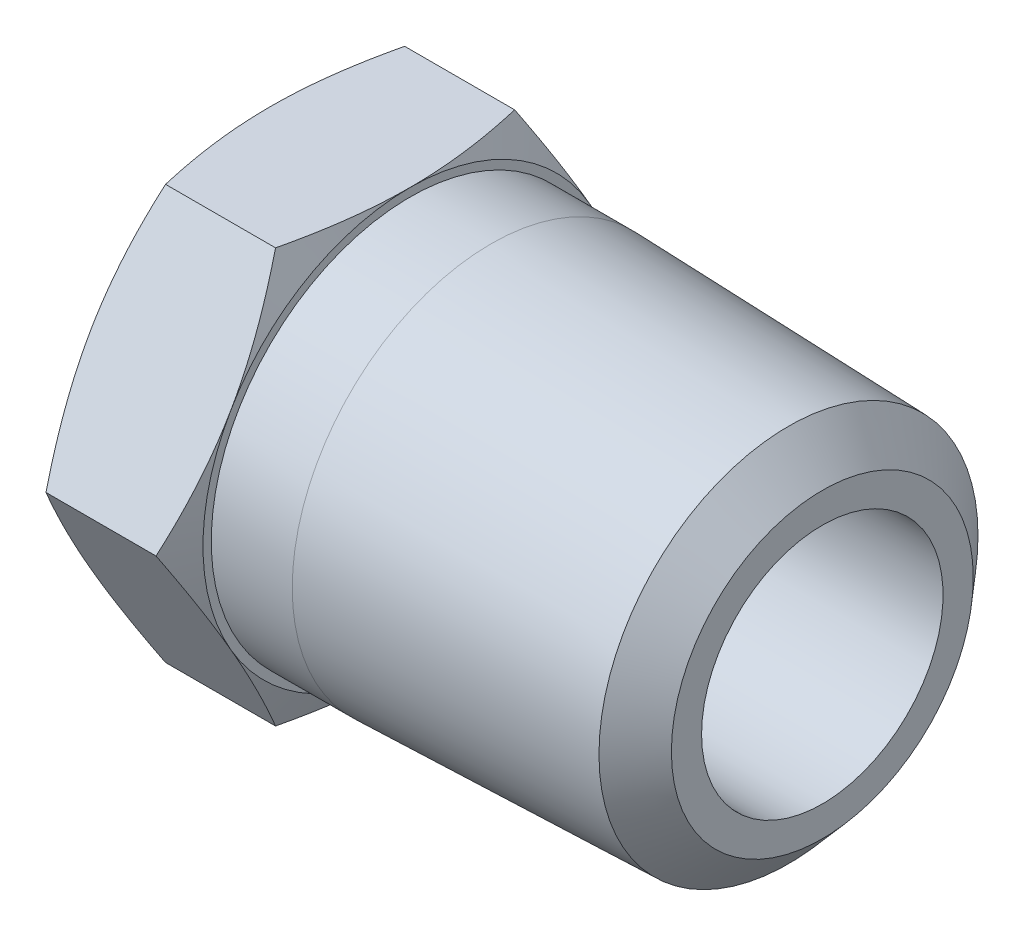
ISO-10303-21;
HEADER;
FILE_DESCRIPTION(('STEP AP214'),'2;1');
FILE_NAME('part.step','',(''),(''),'','','');
FILE_SCHEMA(('AUTOMOTIVE_DESIGN { 1 0 10303 214 1 1 1 1 }'));
ENDSEC;
DATA;
#1=APPLICATION_CONTEXT('core data for automotive mechanical design processes');
#2=APPLICATION_PROTOCOL_DEFINITION('international standard','automotive_design',2000,#1);
#3=PRODUCT_CONTEXT('',#1,'mechanical');
#4=PRODUCT('Part','Part','',(#3));
#5=PRODUCT_RELATED_PRODUCT_CATEGORY('part','',(#4));
#6=PRODUCT_DEFINITION_FORMATION('','',#4);
#7=PRODUCT_DEFINITION_CONTEXT('part definition',#1,'design');
#8=PRODUCT_DEFINITION('design','',#6,#7);
#9=PRODUCT_DEFINITION_SHAPE('','',#8);
#10=(LENGTH_UNIT() NAMED_UNIT(*) SI_UNIT(.MILLI.,.METRE.));
#11=(NAMED_UNIT(*) PLANE_ANGLE_UNIT() SI_UNIT($,.RADIAN.));
#12=(NAMED_UNIT(*) SI_UNIT($,.STERADIAN.) SOLID_ANGLE_UNIT());
#13=UNCERTAINTY_MEASURE_WITH_UNIT(LENGTH_MEASURE(1.E-05),#10,'distance_accuracy_value','');
#14=(GEOMETRIC_REPRESENTATION_CONTEXT(3) GLOBAL_UNCERTAINTY_ASSIGNED_CONTEXT((#13)) GLOBAL_UNIT_ASSIGNED_CONTEXT((#10,
#11,#12)) REPRESENTATION_CONTEXT('',''));
#15=CARTESIAN_POINT('',(0.,0.,0.));
#16=DIRECTION('',(0.,0.,1.));
#17=DIRECTION('',(1.,0.,0.));
#18=AXIS2_PLACEMENT_3D('',#15,#16,#17);
#19=CARTESIAN_POINT('',(-2.8421709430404E-10,0.,0.));
#20=DIRECTION('',(-1.,0.,0.));
#21=DIRECTION('',(0.,0.,1.));
#22=AXIS2_PLACEMENT_3D('',#19,#20,#21);
#23=CONICAL_SURFACE('',#22,5.46099999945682,0.816517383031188);
#24=CARTESIAN_POINT('',(0.912001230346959,0.,0.));
#25=DIRECTION('',(-1.,0.,0.));
#26=DIRECTION('',(0.,1.,0.));
#27=AXIS2_PLACEMENT_3D('',#24,#25,#26);
#28=CIRCLE('',#27,4.49039459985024);
#29=CARTESIAN_POINT('',(0.912001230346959,4.49039459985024,0.));
#30=VERTEX_POINT('',#29);
#31=EDGE_CURVE('E380',#30,#30,#28,.F.);
#32=ORIENTED_EDGE('',*,*,#31,.T.);
#33=EDGE_LOOP('',(#32));
#34=FACE_BOUND('',#33,.T.);
#35=CARTESIAN_POINT('',(-4.44450907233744E-10,0.,0.));
#36=DIRECTION('',(-1.,0.,0.));
#37=DIRECTION('',(0.,0.,1.));
#38=AXIS2_PLACEMENT_3D('',#35,#36,#37);
#39=CIRCLE('',#38,5.46099999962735);
#40=CARTESIAN_POINT('',(-4.44450907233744E-10,0.,5.46099999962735));
#41=VERTEX_POINT('',#40);
#42=EDGE_CURVE('E20',#41,#41,#39,.T.);
#43=ORIENTED_EDGE('',*,*,#42,.T.);
#44=EDGE_LOOP('',(#43));
#45=FACE_BOUND('',#44,.T.);
#46=ADVANCED_FACE('F16',(#34,#45),#23,.F.);
#47=CARTESIAN_POINT('',(0.91200123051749,0.,0.));
#48=DIRECTION('',(-1.,0.,0.));
#49=DIRECTION('',(0.,0.,1.));
#50=AXIS2_PLACEMENT_3D('',#47,#48,#49);
#51=CONICAL_SURFACE('',#50,4.49039459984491,0.0311192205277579);
#52=CARTESIAN_POINT('',(6.858,0.,0.));
#53=DIRECTION('',(1.,0.,0.));
#54=DIRECTION('',(0.,0.,-1.));
#55=AXIS2_PLACEMENT_3D('',#52,#53,#54);
#56=CIRCLE('',#55,4.3053);
#57=CARTESIAN_POINT('',(6.858,0.,-4.3053));
#58=VERTEX_POINT('',#57);
#59=EDGE_CURVE('E114',#58,#58,#56,.T.);
#60=ORIENTED_EDGE('',*,*,#59,.T.);
#61=EDGE_LOOP('',(#60));
#62=FACE_BOUND('',#61,.T.);
#63=ORIENTED_EDGE('',*,*,#31,.F.);
#64=EDGE_LOOP('',(#63));
#65=FACE_BOUND('',#64,.T.);
#66=ADVANCED_FACE('F616',(#62,#65),#51,.F.);
#67=CARTESIAN_POINT('',(0.,0.,0.));
#68=DIRECTION('',(1.,0.,0.));
#69=DIRECTION('',(0.,0.,-1.));
#70=AXIS2_PLACEMENT_3D('',#67,#68,#69);
#71=PLANE('',#70);
#72=ORIENTED_EDGE('',*,*,#42,.F.);
#73=EDGE_LOOP('',(#72));
#74=FACE_BOUND('',#73,.T.);
#75=CARTESIAN_POINT('',(-4.63025830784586E-09,0.,0.));
#76=DIRECTION('',(1.,0.,0.));
#77=DIRECTION('',(0.,0.,-1.));
#78=AXIS2_PLACEMENT_3D('',#75,#76,#77);
#79=CIRCLE('',#78,7.14375000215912);
#80=CARTESIAN_POINT('',(-5.13366725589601E-09,-3.57187500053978,-6.18666897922));
#81=VERTEX_POINT('',#80);
#82=CARTESIAN_POINT('',(-5.13366519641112E-09,3.57187500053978,-6.18666897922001));
#83=VERTEX_POINT('',#82);
#84=EDGE_CURVE('E106',#81,#83,#79,.T.);
#85=ORIENTED_EDGE('',*,*,#84,.F.);
#86=CARTESIAN_POINT('',(-4.63025581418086E-09,0.,0.));
#87=DIRECTION('',(1.,0.,0.));
#88=DIRECTION('',(0.,0.,-1.));
#89=AXIS2_PLACEMENT_3D('',#86,#87,#88);
#90=CIRCLE('',#89,7.14375000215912);
#91=CARTESIAN_POINT('',(-5.13366379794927E-09,-7.14375000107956,0.));
#92=VERTEX_POINT('',#91);
#93=EDGE_CURVE('E125',#92,#81,#90,.T.);
#94=ORIENTED_EDGE('',*,*,#93,.F.);
#95=CARTESIAN_POINT('',(-4.63025874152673E-09,0.,0.));
#96=DIRECTION('',(1.,0.,0.));
#97=DIRECTION('',(0.,0.,-1.));
#98=AXIS2_PLACEMENT_3D('',#95,#96,#97);
#99=CIRCLE('',#98,7.14375000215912);
#100=CARTESIAN_POINT('',(-5.13366665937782E-09,-3.57187500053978,6.18666897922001));
#101=VERTEX_POINT('',#100);
#102=EDGE_CURVE('E445',#101,#92,#99,.T.);
#103=ORIENTED_EDGE('',*,*,#102,.F.);
#104=CARTESIAN_POINT('',(-4.63025874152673E-09,0.,0.));
#105=DIRECTION('',(1.,0.,0.));
#106=DIRECTION('',(0.,0.,-1.));
#107=AXIS2_PLACEMENT_3D('',#104,#105,#106);
#108=CIRCLE('',#107,7.14375000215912);
#109=CARTESIAN_POINT('',(-5.13366760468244E-09,3.57187500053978,6.18666897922));
#110=VERTEX_POINT('',#109);
#111=EDGE_CURVE('E447',#110,#101,#108,.T.);
#112=ORIENTED_EDGE('',*,*,#111,.F.);
#113=CARTESIAN_POINT('',(-4.63026524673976E-09,0.,0.));
#114=DIRECTION('',(1.,0.,0.));
#115=DIRECTION('',(0.,0.,-1.));
#116=AXIS2_PLACEMENT_3D('',#113,#114,#115);
#117=CIRCLE('',#116,7.1437500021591);
#118=CARTESIAN_POINT('',(-5.13367419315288E-09,7.14375000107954,0.));
#119=VERTEX_POINT('',#118);
#120=EDGE_CURVE('E109',#119,#110,#117,.T.);
#121=ORIENTED_EDGE('',*,*,#120,.F.);
#122=CARTESIAN_POINT('',(-4.63025841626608E-09,0.,0.));
#123=DIRECTION('',(1.,0.,0.));
#124=DIRECTION('',(0.,0.,-1.));
#125=AXIS2_PLACEMENT_3D('',#122,#123,#124);
#126=CIRCLE('',#125,7.14375000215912);
#127=EDGE_CURVE('E103',#83,#119,#126,.T.);
#128=ORIENTED_EDGE('',*,*,#127,.F.);
#129=EDGE_LOOP('',(#85,#94,#103,#112,#121,#128));
#130=FACE_BOUND('',#129,.T.);
#131=ADVANCED_FACE('F105',(#74,#130),#71,.F.);
#132=CARTESIAN_POINT('',(6.858,0.,0.));
#133=DIRECTION('',(1.,0.,0.));
#134=DIRECTION('',(0.,0.,-1.));
#135=AXIS2_PLACEMENT_3D('',#132,#133,#134);
#136=CYLINDRICAL_SURFACE('',#135,4.3053);
#137=ORIENTED_EDGE('',*,*,#59,.F.);
#138=EDGE_LOOP('',(#137));
#139=FACE_BOUND('',#138,.T.);
#140=CARTESIAN_POINT('',(9.652,0.,0.));
#141=DIRECTION('',(1.,0.,0.));
#142=DIRECTION('',(0.,0.,-1.));
#143=AXIS2_PLACEMENT_3D('',#140,#141,#142);
#144=CIRCLE('',#143,4.3053);
#145=CARTESIAN_POINT('',(9.652,0.,-4.3053));
#146=VERTEX_POINT('',#145);
#147=EDGE_CURVE('E124',#146,#146,#144,.T.);
#148=ORIENTED_EDGE('',*,*,#147,.T.);
#149=EDGE_LOOP('',(#148));
#150=FACE_BOUND('',#149,.T.);
#151=ADVANCED_FACE('F604',(#139,#150),#136,.F.);
#152=CARTESIAN_POINT('',(0.518428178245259,0.,0.));
#153=DIRECTION('',(1.,0.,0.));
#154=DIRECTION('',(0.,0.,-1.));
#155=AXIS2_PLACEMENT_3D('',#152,#153,#154);
#156=CONICAL_SURFACE('',#155,8.25552282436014,1.1344640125);
#157=ORIENTED_EDGE('',*,*,#127,.T.);
#158=CARTESIAN_POINT('',(0.515336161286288,7.14374999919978,-4.12444598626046));
#159=CARTESIAN_POINT('',(0.436409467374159,7.14374999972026,-3.7860516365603));
#160=CARTESIAN_POINT('',(0.364380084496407,7.14374999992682,-3.44583405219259));
#161=CARTESIAN_POINT('',(0.237587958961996,7.14375000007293,-2.76340602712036));
#162=CARTESIAN_POINT('',(0.182767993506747,7.14375000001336,-2.42120612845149));
#163=CARTESIAN_POINT('',(0.115642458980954,7.14374999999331,-1.90579460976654));
#164=CARTESIAN_POINT('',(0.0957794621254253,7.1437499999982,-1.73356525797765));
#165=CARTESIAN_POINT('',(0.0614360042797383,7.1437500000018,-1.38856894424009));
#166=CARTESIAN_POINT('',(0.046955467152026,7.14375000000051,-1.21580198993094));
#167=CARTESIAN_POINT('',(0.0236193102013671,7.14374999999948,-0.869306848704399));
#168=CARTESIAN_POINT('',(0.0147826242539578,7.14374999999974,-0.695577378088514));
#169=CARTESIAN_POINT('',(0.00296230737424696,7.14375000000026,-0.347900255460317));
#170=CARTESIAN_POINT('',(-2.06506062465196E-05,7.14375000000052,-0.173952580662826));
#171=CARTESIAN_POINT('',(-5.63708322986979E-09,7.14375,-1.09536908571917E-10));
#172=B_SPLINE_CURVE_WITH_KNOTS('',3,(#158,#159,#160,#161,#162,#163,#164,#165,#166,#167,#168,
#169,#170,#171),.UNSPECIFIED.,.F.,.F.,(4,2,2,2,2,2,4),(0.,1.04269338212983,2.08188206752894,
2.60191814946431,3.12194687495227,3.64371114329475,4.16553539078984),.UNSPECIFIED.);
#173=CARTESIAN_POINT('',(0.515336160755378,7.14375000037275,-4.1244459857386));
#174=VERTEX_POINT('',#173);
#175=EDGE_CURVE('E130',#174,#119,#172,.T.);
#176=ORIENTED_EDGE('',*,*,#175,.F.);
#177=CARTESIAN_POINT('',(-5.16726322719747E-09,3.57187499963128,-6.18666897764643));
#178=CARTESIAN_POINT('',(-2.06504383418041E-05,3.72252235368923,-6.09969268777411));
#179=CARTESIAN_POINT('',(0.00296230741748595,3.87316545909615,-6.01271885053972));
#180=CARTESIAN_POINT('',(0.0147826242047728,4.17426267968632,-5.83888028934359));
#181=CARTESIAN_POINT('',(0.0236193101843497,4.32471681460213,-5.75201555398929));
#182=CARTESIAN_POINT('',(0.0469554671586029,4.62479040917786,-5.57876798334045));
#183=CARTESIAN_POINT('',(0.0614360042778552,4.77441098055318,-5.49238450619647));
#184=CARTESIAN_POINT('',(0.0957794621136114,5.07318655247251,-5.3198863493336));
#185=CARTESIAN_POINT('',(0.115642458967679,5.2223415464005,-5.23377167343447));
#186=CARTESIAN_POINT('',(0.18276799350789,5.66870101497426,-4.97606591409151));
#187=CARTESIAN_POINT('',(0.237587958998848,5.96505482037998,-4.80496596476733));
#188=CARTESIAN_POINT('',(0.364380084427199,6.55605482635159,-4.46375195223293));
#189=CARTESIAN_POINT('',(0.436409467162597,6.8506918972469,-4.29364316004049));
#190=CARTESIAN_POINT('',(0.515336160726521,7.14375000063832,-4.12444598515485));
#191=B_SPLINE_CURVE_WITH_KNOTS('',3,(#177,#178,#179,#180,#181,#182,#183,#184,#185,#186,#187,
#188,#189,#190),.UNSPECIFIED.,.F.,.F.,(4,2,2,2,2,2,4),(0.,0.521824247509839,1.04358851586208,
1.56361724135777,2.08365332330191,3.12284200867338,4.16553539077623),.UNSPECIFIED.);
#192=EDGE_CURVE('E127',#83,#174,#191,.T.);
#193=ORIENTED_EDGE('',*,*,#192,.F.);
#194=EDGE_LOOP('',(#157,#176,#193));
#195=FACE_BOUND('',#194,.T.);
#196=ADVANCED_FACE('F128',(#195),#156,.T.);
#197=CARTESIAN_POINT('',(0.518428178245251,0.,0.));
#198=DIRECTION('',(1.,0.,0.));
#199=DIRECTION('',(0.,0.,-1.));
#200=AXIS2_PLACEMENT_3D('',#197,#198,#199);
#201=CONICAL_SURFACE('',#200,8.25552282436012,1.1344640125);
#202=CARTESIAN_POINT('',(-5.16727565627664E-09,7.14374999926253,0.));
#203=CARTESIAN_POINT('',(-2.06504383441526E-05,7.14374999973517,0.173952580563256));
#204=CARTESIAN_POINT('',(0.00296230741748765,7.14374999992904,0.347900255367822));
#205=CARTESIAN_POINT('',(0.0147826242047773,7.14375000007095,0.695577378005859));
#206=CARTESIAN_POINT('',(0.0236193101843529,7.14375000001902,0.869306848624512));
#207=CARTESIAN_POINT('',(0.046955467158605,7.14374999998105,1.21580198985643));
#208=CARTESIAN_POINT('',(0.0614360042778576,7.14374999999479,1.38856894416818));
#209=CARTESIAN_POINT('',(0.095779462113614,7.14375000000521,1.73356525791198));
#210=CARTESIAN_POINT('',(0.115642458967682,7.1437500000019,1.90579460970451));
#211=CARTESIAN_POINT('',(0.182767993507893,7.14374999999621,2.42120612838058));
#212=CARTESIAN_POINT('',(0.237587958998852,7.1437499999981,2.76340602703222));
#213=CARTESIAN_POINT('',(0.364380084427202,7.1437500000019,3.44583405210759));
#214=CARTESIAN_POINT('',(0.436409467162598,7.14375000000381,3.78605163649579));
#215=CARTESIAN_POINT('',(0.515336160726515,7.14375,4.12444598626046));
#216=B_SPLINE_CURVE_WITH_KNOTS('',3,(#202,#203,#204,#205,#206,#207,#208,#209,#210,#211,#212,
#213,#214,#215),.UNSPECIFIED.,.F.,.F.,(4,2,2,2,2,2,4),(0.,0.52182424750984,1.04358851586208,
1.56361724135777,2.08365332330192,3.12284200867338,4.16553539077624),.UNSPECIFIED.);
#217=CARTESIAN_POINT('',(0.515336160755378,7.14375000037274,4.1244459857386));
#218=VERTEX_POINT('',#217);
#219=EDGE_CURVE('E299',#119,#218,#216,.T.);
#220=ORIENTED_EDGE('',*,*,#219,.F.);
#221=ORIENTED_EDGE('',*,*,#120,.T.);
#222=CARTESIAN_POINT('',(0.515336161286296,7.14375000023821,4.12444598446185));
#223=CARTESIAN_POINT('',(0.436409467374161,6.85069189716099,4.29364315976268));
#224=CARTESIAN_POINT('',(0.364380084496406,6.55605482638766,4.46375195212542));
#225=CARTESIAN_POINT('',(0.237587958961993,5.96505482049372,4.80496596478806));
#226=CARTESIAN_POINT('',(0.182767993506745,5.66870101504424,4.9760659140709));
#227=CARTESIAN_POINT('',(0.115642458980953,5.22234154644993,5.23377167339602));
#228=CARTESIAN_POINT('',(0.0957794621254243,5.07318655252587,5.31988634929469));
#229=CARTESIAN_POINT('',(0.0614360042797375,4.77441098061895,5.49238450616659));
#230=CARTESIAN_POINT('',(0.0469554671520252,4.62479040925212,5.57876798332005));
#231=CARTESIAN_POINT('',(0.0236193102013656,4.32471681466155,5.75201555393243));
#232=CARTESIAN_POINT('',(0.0147826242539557,4.1742626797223,5.8388802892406));
#233=CARTESIAN_POINT('',(0.00296230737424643,3.87316545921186,6.01271885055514));
#234=CARTESIAN_POINT('',(-2.06506062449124E-05,3.72252235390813,6.09969268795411));
#235=CARTESIAN_POINT('',(-5.63707645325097E-09,3.57187500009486,6.1866689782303));
#236=B_SPLINE_CURVE_WITH_KNOTS('',3,(#222,#223,#224,#225,#226,#227,#228,#229,#230,#231,#232,
#233,#234,#235),.UNSPECIFIED.,.F.,.F.,(4,2,2,2,2,2,4),(0.,1.04269338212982,2.08188206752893,
2.6019181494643,3.12194687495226,3.64371114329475,4.16553539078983),.UNSPECIFIED.);
#237=EDGE_CURVE('E292',#218,#110,#236,.T.);
#238=ORIENTED_EDGE('',*,*,#237,.F.);
#239=EDGE_LOOP('',(#220,#221,#238));
#240=FACE_BOUND('',#239,.T.);
#241=ADVANCED_FACE('F282',(#240),#201,.T.);
#242=CARTESIAN_POINT('',(0.518428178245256,0.,0.));
#243=DIRECTION('',(1.,0.,0.));
#244=DIRECTION('',(0.,0.,-1.));
#245=AXIS2_PLACEMENT_3D('',#242,#243,#244);
#246=CONICAL_SURFACE('',#245,8.25552282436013,1.1344640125);
#247=CARTESIAN_POINT('',(-5.16726926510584E-09,3.57187499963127,6.18666897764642));
#248=CARTESIAN_POINT('',(-2.06504383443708E-05,3.42122764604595,6.27364526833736));
#249=CARTESIAN_POINT('',(0.00296230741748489,3.27058454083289,6.36061910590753));
#250=CARTESIAN_POINT('',(0.0147826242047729,2.96948732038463,6.53445766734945));
#251=CARTESIAN_POINT('',(0.0236193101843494,2.81903318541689,6.6213224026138));
#252=CARTESIAN_POINT('',(0.046955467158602,2.51895959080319,6.79456997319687));
#253=CARTESIAN_POINT('',(0.0614360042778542,2.36933901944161,6.88095345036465));
#254=CARTESIAN_POINT('',(0.0957794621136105,2.07056344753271,7.05345160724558));
#255=CARTESIAN_POINT('',(0.115642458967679,1.92140845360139,7.13956628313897));
#256=CARTESIAN_POINT('',(0.18276799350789,1.47504898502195,7.39727204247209));
#257=CARTESIAN_POINT('',(0.237587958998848,1.17869517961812,7.56837199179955));
#258=CARTESIAN_POINT('',(0.364380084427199,0.587695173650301,7.90958600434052));
#259=CARTESIAN_POINT('',(0.436409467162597,0.293058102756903,8.07969479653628));
#260=CARTESIAN_POINT('',(0.51533616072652,-6.3832992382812E-10,8.24889197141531));
#261=B_SPLINE_CURVE_WITH_KNOTS('',3,(#247,#248,#249,#250,#251,#252,#253,#254,#255,#256,#257,
#258,#259,#260),.UNSPECIFIED.,.F.,.F.,(4,2,2,2,2,2,4),(0.,0.521824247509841,1.04358851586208,
1.56361724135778,2.08365332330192,3.12284200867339,4.16553539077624),.UNSPECIFIED.);
#262=CARTESIAN_POINT('',(0.515336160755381,0.,8.2488919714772));
#263=VERTEX_POINT('',#262);
#264=EDGE_CURVE('E286',#110,#263,#261,.T.);
#265=ORIENTED_EDGE('',*,*,#264,.F.);
#266=ORIENTED_EDGE('',*,*,#111,.T.);
#267=CARTESIAN_POINT('',(0.515336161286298,1.03842624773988E-09,8.24889197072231));
#268=CARTESIAN_POINT('',(0.436409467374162,-0.293058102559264,8.07969479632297));
#269=CARTESIAN_POINT('',(0.364380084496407,-0.587695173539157,7.909586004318));
#270=CARTESIAN_POINT('',(0.237587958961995,-1.1786951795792,7.56837199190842));
#271=CARTESIAN_POINT('',(0.182767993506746,-1.47504898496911,7.3972720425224));
#272=CARTESIAN_POINT('',(0.115642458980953,-1.92140845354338,7.13956628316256));
#273=CARTESIAN_POINT('',(0.0957794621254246,-2.07056344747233,7.05345160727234));
#274=CARTESIAN_POINT('',(0.0614360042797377,-2.36933901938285,6.88095345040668));
#275=CARTESIAN_POINT('',(0.0469554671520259,-2.51895959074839,6.79456997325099));
#276=CARTESIAN_POINT('',(0.0236193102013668,-2.81903318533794,6.62132240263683));
#277=CARTESIAN_POINT('',(0.0147826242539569,-2.96948732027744,6.53445766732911));
#278=CARTESIAN_POINT('',(0.00296230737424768,-3.2705845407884,6.36061910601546));
#279=CARTESIAN_POINT('',(-2.06506062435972E-05,-3.42122764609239,6.27364526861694));
#280=CARTESIAN_POINT('',(-5.63707475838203E-09,-3.57187499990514,6.18666897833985));
#281=B_SPLINE_CURVE_WITH_KNOTS('',3,(#267,#268,#269,#270,#271,#272,#273,#274,#275,#276,#277,
#278,#279,#280),.UNSPECIFIED.,.F.,.F.,(4,2,2,2,2,2,4),(0.,1.04269338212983,2.08188206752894,
2.60191814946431,3.12194687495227,3.64371114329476,4.16553539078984),.UNSPECIFIED.);
#282=EDGE_CURVE('E263',#263,#101,#281,.T.);
#283=ORIENTED_EDGE('',*,*,#282,.F.);
#284=EDGE_LOOP('',(#265,#266,#283));
#285=FACE_BOUND('',#284,.T.);
#286=ADVANCED_FACE('F276',(#285),#246,.T.);
#287=CARTESIAN_POINT('',(0.518428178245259,0.,0.));
#288=DIRECTION('',(1.,0.,0.));
#289=DIRECTION('',(0.,0.,-1.));
#290=AXIS2_PLACEMENT_3D('',#287,#288,#289);
#291=CONICAL_SURFACE('',#290,8.25552282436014,1.1344640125);
#292=CARTESIAN_POINT('',(-5.16726727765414E-09,-3.57187499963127,6.18666897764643));
#293=CARTESIAN_POINT('',(-2.06504383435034E-05,-3.72252235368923,6.09969268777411));
#294=CARTESIAN_POINT('',(0.00296230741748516,-3.87316545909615,6.01271885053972));
#295=CARTESIAN_POINT('',(0.0147826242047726,-4.17426267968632,5.83888028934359));
#296=CARTESIAN_POINT('',(0.0236193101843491,-4.32471681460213,5.75201555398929));
#297=CARTESIAN_POINT('',(0.0469554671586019,-4.62479040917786,5.57876798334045));
#298=CARTESIAN_POINT('',(0.0614360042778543,-4.77441098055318,5.49238450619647));
#299=CARTESIAN_POINT('',(0.0957794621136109,-5.07318655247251,5.3198863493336));
#300=CARTESIAN_POINT('',(0.115642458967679,-5.2223415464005,5.23377167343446));
#301=CARTESIAN_POINT('',(0.182767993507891,-5.66870101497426,4.97606591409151));
#302=CARTESIAN_POINT('',(0.237587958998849,-5.96505482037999,4.80496596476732));
#303=CARTESIAN_POINT('',(0.364380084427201,-6.5560548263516,4.46375195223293));
#304=CARTESIAN_POINT('',(0.436409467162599,-6.85069189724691,4.29364316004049));
#305=CARTESIAN_POINT('',(0.515336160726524,-7.14375000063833,4.12444598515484));
#306=B_SPLINE_CURVE_WITH_KNOTS('',3,(#292,#293,#294,#295,#296,#297,#298,#299,#300,#301,#302,
#303,#304,#305),.UNSPECIFIED.,.F.,.F.,(4,2,2,2,2,2,4),(0.,0.521824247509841,1.04358851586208,
1.56361724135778,2.08365332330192,3.12284200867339,4.16553539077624),.UNSPECIFIED.);
#307=CARTESIAN_POINT('',(0.515336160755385,-7.14375000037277,4.1244459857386));
#308=VERTEX_POINT('',#307);
#309=EDGE_CURVE('E257',#101,#308,#306,.T.);
#310=ORIENTED_EDGE('',*,*,#309,.F.);
#311=ORIENTED_EDGE('',*,*,#102,.T.);
#312=CARTESIAN_POINT('',(0.5153361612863,-7.1437499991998,4.12444598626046));
#313=CARTESIAN_POINT('',(0.436409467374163,-7.14374999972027,3.7860516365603));
#314=CARTESIAN_POINT('',(0.364380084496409,-7.14374999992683,3.44583405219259));
#315=CARTESIAN_POINT('',(0.237587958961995,-7.14375000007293,2.76340602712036));
#316=CARTESIAN_POINT('',(0.182767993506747,-7.14375000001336,2.4212061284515));
#317=CARTESIAN_POINT('',(0.115642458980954,-7.14374999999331,1.90579460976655));
#318=CARTESIAN_POINT('',(0.0957794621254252,-7.1437499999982,1.73356525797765));
#319=CARTESIAN_POINT('',(0.0614360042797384,-7.1437500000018,1.38856894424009));
#320=CARTESIAN_POINT('',(0.0469554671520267,-7.14375000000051,1.21580198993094));
#321=CARTESIAN_POINT('',(0.0236193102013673,-7.14374999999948,0.8693068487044));
#322=CARTESIAN_POINT('',(0.0147826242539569,-7.14374999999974,0.695577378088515));
#323=CARTESIAN_POINT('',(0.00296230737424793,-7.14375000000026,0.347900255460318));
#324=CARTESIAN_POINT('',(-2.06506062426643E-05,-7.14375000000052,0.173952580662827));
#325=CARTESIAN_POINT('',(-5.63707173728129E-09,-7.14375,1.0953768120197E-10));
#326=B_SPLINE_CURVE_WITH_KNOTS('',3,(#312,#313,#314,#315,#316,#317,#318,#319,#320,#321,#322,
#323,#324,#325),.UNSPECIFIED.,.F.,.F.,(4,2,2,2,2,2,4),(0.,1.04269338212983,2.08188206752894,
2.60191814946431,3.12194687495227,3.64371114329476,4.16553539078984),.UNSPECIFIED.);
#327=EDGE_CURVE('E264',#308,#92,#326,.T.);
#328=ORIENTED_EDGE('',*,*,#327,.F.);
#329=EDGE_LOOP('',(#310,#311,#328));
#330=FACE_BOUND('',#329,.T.);
#331=ADVANCED_FACE('F273',(#330),#291,.T.);
#332=CARTESIAN_POINT('',(0.518428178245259,0.,0.));
#333=DIRECTION('',(1.,0.,0.));
#334=DIRECTION('',(0.,0.,-1.));
#335=AXIS2_PLACEMENT_3D('',#332,#333,#334);
#336=CONICAL_SURFACE('',#335,8.25552282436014,1.1344640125);
#337=ORIENTED_EDGE('',*,*,#93,.T.);
#338=CARTESIAN_POINT('',(0.515336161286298,-7.14375000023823,-4.12444598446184));
#339=CARTESIAN_POINT('',(0.436409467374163,-6.85069189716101,-4.29364315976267));
#340=CARTESIAN_POINT('',(0.364380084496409,-6.55605482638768,-4.46375195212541));
#341=CARTESIAN_POINT('',(0.237587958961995,-5.96505482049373,-4.80496596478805));
#342=CARTESIAN_POINT('',(0.182767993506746,-5.66870101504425,-4.97606591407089));
#343=CARTESIAN_POINT('',(0.115642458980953,-5.22234154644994,-5.23377167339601));
#344=CARTESIAN_POINT('',(0.095779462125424,-5.07318655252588,-5.31988634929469));
#345=CARTESIAN_POINT('',(0.0614360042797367,-4.77441098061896,-5.49238450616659));
#346=CARTESIAN_POINT('',(0.0469554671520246,-4.62479040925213,-5.57876798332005));
#347=CARTESIAN_POINT('',(0.023619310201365,-4.32471681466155,-5.75201555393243));
#348=CARTESIAN_POINT('',(0.0147826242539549,-4.1742626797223,-5.83888028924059));
#349=CARTESIAN_POINT('',(0.00296230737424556,-3.87316545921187,-6.01271885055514));
#350=CARTESIAN_POINT('',(-2.06506062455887E-05,-3.72252235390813,-6.09969268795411));
#351=CARTESIAN_POINT('',(-5.63707632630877E-09,-3.57187500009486,-6.1866689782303));
#352=B_SPLINE_CURVE_WITH_KNOTS('',3,(#338,#339,#340,#341,#342,#343,#344,#345,#346,#347,#348,
#349,#350,#351),.UNSPECIFIED.,.F.,.F.,(4,2,2,2,2,2,4),(0.,1.04269338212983,2.08188206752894,
2.60191814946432,3.12194687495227,3.64371114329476,4.16553539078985),.UNSPECIFIED.);
#353=CARTESIAN_POINT('',(0.515336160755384,-7.14375000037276,-4.1244459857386));
#354=VERTEX_POINT('',#353);
#355=EDGE_CURVE('E168',#354,#81,#352,.T.);
#356=ORIENTED_EDGE('',*,*,#355,.F.);
#357=CARTESIAN_POINT('',(-5.16726467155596E-09,-7.14374999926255,0.));
#358=CARTESIAN_POINT('',(-2.06504383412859E-05,-7.14374999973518,-0.173952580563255));
#359=CARTESIAN_POINT('',(0.00296230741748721,-7.14374999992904,-0.347900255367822));
#360=CARTESIAN_POINT('',(0.0147826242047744,-7.14375000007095,-0.695577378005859));
#361=CARTESIAN_POINT('',(0.023619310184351,-7.14375000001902,-0.869306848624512));
#362=CARTESIAN_POINT('',(0.0469554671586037,-7.14374999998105,-1.21580198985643));
#363=CARTESIAN_POINT('',(0.061436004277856,-7.14374999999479,-1.38856894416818));
#364=CARTESIAN_POINT('',(0.0957794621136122,-7.14375000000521,-1.73356525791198));
#365=CARTESIAN_POINT('',(0.11564245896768,-7.1437500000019,-1.90579460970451));
#366=CARTESIAN_POINT('',(0.182767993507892,-7.14374999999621,-2.42120612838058));
#367=CARTESIAN_POINT('',(0.237587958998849,-7.1437499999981,-2.76340602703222));
#368=CARTESIAN_POINT('',(0.3643800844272,-7.1437500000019,-3.44583405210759));
#369=CARTESIAN_POINT('',(0.436409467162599,-7.14375000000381,-3.78605163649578));
#370=CARTESIAN_POINT('',(0.515336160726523,-7.14375,-4.12444598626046));
#371=B_SPLINE_CURVE_WITH_KNOTS('',3,(#357,#358,#359,#360,#361,#362,#363,#364,#365,#366,#367,
#368,#369,#370),.UNSPECIFIED.,.F.,.F.,(4,2,2,2,2,2,4),(0.,0.52182424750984,1.04358851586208,
1.56361724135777,2.08365332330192,3.12284200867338,4.16553539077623),.UNSPECIFIED.);
#372=EDGE_CURVE('E370',#92,#354,#371,.T.);
#373=ORIENTED_EDGE('',*,*,#372,.F.);
#374=EDGE_LOOP('',(#337,#356,#373));
#375=FACE_BOUND('',#374,.T.);
#376=ADVANCED_FACE('F157',(#375),#336,.T.);
#377=CARTESIAN_POINT('',(0.518428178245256,0.,0.));
#378=DIRECTION('',(1.,0.,0.));
#379=DIRECTION('',(0.,0.,-1.));
#380=AXIS2_PLACEMENT_3D('',#377,#378,#379);
#381=CONICAL_SURFACE('',#380,8.25552282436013,1.1344640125);
#382=ORIENTED_EDGE('',*,*,#84,.T.);
#383=CARTESIAN_POINT('',(0.515336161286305,-1.03842348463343E-09,-8.24889197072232));
#384=CARTESIAN_POINT('',(0.436409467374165,0.293058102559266,-8.07969479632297));
#385=CARTESIAN_POINT('',(0.36438008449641,0.587695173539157,-7.90958600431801));
#386=CARTESIAN_POINT('',(0.237587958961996,1.1786951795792,-7.56837199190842));
#387=CARTESIAN_POINT('',(0.182767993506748,1.47504898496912,-7.3972720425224));
#388=CARTESIAN_POINT('',(0.115642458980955,1.92140845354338,-7.13956628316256));
#389=CARTESIAN_POINT('',(0.0957794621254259,2.07056344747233,-7.05345160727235));
#390=CARTESIAN_POINT('',(0.0614360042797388,2.36933901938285,-6.88095345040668));
#391=CARTESIAN_POINT('',(0.0469554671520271,2.51895959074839,-6.794569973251));
#392=CARTESIAN_POINT('',(0.023619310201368,2.81903318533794,-6.62132240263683));
#393=CARTESIAN_POINT('',(0.0147826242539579,2.96948732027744,-6.53445766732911));
#394=CARTESIAN_POINT('',(0.00296230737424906,3.2705845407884,-6.36061910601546));
#395=CARTESIAN_POINT('',(-2.06506062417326E-05,3.42122764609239,-6.27364526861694));
#396=CARTESIAN_POINT('',(-5.63707169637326E-09,3.57187499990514,-6.18666897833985));
#397=B_SPLINE_CURVE_WITH_KNOTS('',3,(#383,#384,#385,#386,#387,#388,#389,#390,#391,#392,#393,
#394,#395,#396),.UNSPECIFIED.,.F.,.F.,(4,2,2,2,2,2,4),(0.,1.04269338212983,2.08188206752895,
2.60191814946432,3.12194687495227,3.64371114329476,4.16553539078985),.UNSPECIFIED.);
#398=CARTESIAN_POINT('',(0.515336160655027,-3.72760723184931E-10,-8.24889197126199));
#399=VERTEX_POINT('',#398);
#400=EDGE_CURVE('E119',#399,#83,#397,.T.);
#401=ORIENTED_EDGE('',*,*,#400,.F.);
#402=CARTESIAN_POINT('',(-5.16726927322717E-09,-3.57187499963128,-6.18666897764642));
#403=CARTESIAN_POINT('',(-2.06504383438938E-05,-3.42122764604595,-6.27364526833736));
#404=CARTESIAN_POINT('',(0.00296230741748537,-3.2705845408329,-6.36061910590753));
#405=CARTESIAN_POINT('',(0.0147826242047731,-2.96948732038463,-6.53445766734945));
#406=CARTESIAN_POINT('',(0.0236193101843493,-2.81903318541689,-6.6213224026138));
#407=CARTESIAN_POINT('',(0.0469554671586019,-2.51895959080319,-6.79456997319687));
#408=CARTESIAN_POINT('',(0.0614360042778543,-2.36933901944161,-6.88095345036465));
#409=CARTESIAN_POINT('',(0.0957794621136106,-2.07056344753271,-7.05345160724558));
#410=CARTESIAN_POINT('',(0.115642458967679,-1.92140845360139,-7.13956628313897));
#411=CARTESIAN_POINT('',(0.18276799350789,-1.47504898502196,-7.39727204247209));
#412=CARTESIAN_POINT('',(0.237587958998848,-1.17869517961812,-7.56837199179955));
#413=CARTESIAN_POINT('',(0.3643800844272,-0.587695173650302,-7.90958600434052));
#414=CARTESIAN_POINT('',(0.436409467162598,-0.293058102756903,-8.07969479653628));
#415=CARTESIAN_POINT('',(0.51533616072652,6.38330998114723E-10,-8.24889197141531));
#416=B_SPLINE_CURVE_WITH_KNOTS('',3,(#402,#403,#404,#405,#406,#407,#408,#409,#410,#411,#412,
#413,#414,#415),.UNSPECIFIED.,.F.,.F.,(4,2,2,2,2,2,4),(0.,0.521824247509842,1.04358851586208,
1.56361724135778,2.08365332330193,3.12284200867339,4.16553539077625),.UNSPECIFIED.);
#417=EDGE_CURVE('E122',#81,#399,#416,.T.);
#418=ORIENTED_EDGE('',*,*,#417,.F.);
#419=EDGE_LOOP('',(#382,#401,#418));
#420=FACE_BOUND('',#419,.T.);
#421=ADVANCED_FACE('F117',(#420),#381,.T.);
#422=CARTESIAN_POINT('',(9.652,4.3053,4.391406));
#423=DIRECTION('',(1.,0.,0.));
#424=DIRECTION('',(0.,-1.,0.));
#425=AXIS2_PLACEMENT_3D('',#422,#423,#424);
#426=PLANE('',#425);
#427=CARTESIAN_POINT('',(9.652,0.,0.));
#428=DIRECTION('',(-1.,0.,0.));
#429=DIRECTION('',(0.,0.,1.));
#430=AXIS2_PLACEMENT_3D('',#427,#428,#429);
#431=CIRCLE('',#430,4.1656);
#432=CARTESIAN_POINT('',(9.652,0.,4.1656));
#433=VERTEX_POINT('',#432);
#434=EDGE_CURVE('E169',#433,#433,#431,.F.);
#435=ORIENTED_EDGE('',*,*,#434,.T.);
#436=EDGE_LOOP('',(#435));
#437=FACE_BOUND('',#436,.T.);
#438=ORIENTED_EDGE('',*,*,#147,.F.);
#439=EDGE_LOOP('',(#438));
#440=FACE_BOUND('',#439,.T.);
#441=ADVANCED_FACE('F156',(#437,#440),#426,.F.);
#442=CARTESIAN_POINT('',(0.,7.14375,-4.12444598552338));
#443=DIRECTION('',(0.,0.5,-0.866025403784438));
#444=DIRECTION('',(0.,0.866025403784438,0.5));
#445=AXIS2_PLACEMENT_3D('',#442,#443,#444);
#446=PLANE('',#445);
#447=ORIENTED_EDGE('',*,*,#192,.T.);
#448=DIRECTION('',(1.,0.,0.));
#449=VECTOR('',#448,1.);
#450=CARTESIAN_POINT('',(0.,7.14375,-4.12444598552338));
#451=LINE('',#450,#449);
#452=CARTESIAN_POINT('',(4.31066384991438,7.14375,-4.12444594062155));
#453=VERTEX_POINT('',#452);
#454=EDGE_CURVE('E133',#453,#174,#451,.F.);
#455=ORIENTED_EDGE('',*,*,#454,.F.);
#456=CARTESIAN_POINT('',(4.82600000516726,3.57187499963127,-6.18666897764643));
#457=CARTESIAN_POINT('',(4.82602065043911,3.72252235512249,-6.09969268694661));
#458=CARTESIAN_POINT('',(4.82303769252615,3.87316546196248,-6.01271884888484));
#459=CARTESIAN_POINT('',(4.81121737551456,4.17426268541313,-5.83888028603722));
#460=CARTESIAN_POINT('',(4.80238068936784,4.32471682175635,-5.75201554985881));
#461=CARTESIAN_POINT('',(4.77904453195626,4.62479041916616,-5.57876797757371));
#462=CARTESIAN_POINT('',(4.76456399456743,4.77441099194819,-5.49238449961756));
#463=CARTESIAN_POINT('',(4.73022053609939,5.07318656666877,-5.31988634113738));
#464=CARTESIAN_POINT('',(4.71035753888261,5.22234156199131,-5.23377166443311));
#465=CARTESIAN_POINT('',(4.64323200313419,5.66870103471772,-4.97606590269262));
#466=CARTESIAN_POINT('',(4.58841203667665,5.96505484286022,-4.80496595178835));
#467=CARTESIAN_POINT('',(4.4616199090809,6.55605485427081,-4.46375193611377));
#468=CARTESIAN_POINT('',(4.38959052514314,6.850691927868,-4.29364314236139));
#469=CARTESIAN_POINT('',(4.31066383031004,7.14375003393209,-4.12444596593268));
#470=B_SPLINE_CURVE_WITH_KNOTS('',3,(#456,#457,#458,#459,#460,#461,#462,#463,#464,#465,#466,
#467,#468,#469),.UNSPECIFIED.,.F.,.F.,(4,2,2,2,2,2,4),(0.,0.521824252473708,1.04358852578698,
1.5636172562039,2.08365334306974,3.12284203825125,4.16553543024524),.UNSPECIFIED.);
#471=CARTESIAN_POINT('',(4.82600000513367,3.57187500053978,-6.18666897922));
#472=VERTEX_POINT('',#471);
#473=EDGE_CURVE('E343',#472,#453,#470,.T.);
#474=ORIENTED_EDGE('',*,*,#473,.F.);
#475=CARTESIAN_POINT('',(4.31066385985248,7.74793611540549E-08,-8.24889192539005));
#476=CARTESIAN_POINT('',(4.38959055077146,0.293058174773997,-8.07969475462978));
#477=CARTESIAN_POINT('',(4.46161993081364,0.587695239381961,-7.90958596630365));
#478=CARTESIAN_POINT('',(4.58841205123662,1.17869523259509,-7.56837196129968));
#479=CARTESIAN_POINT('',(4.64323201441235,1.47504903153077,-7.39727201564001));
#480=CARTESIAN_POINT('',(4.71035754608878,1.92140849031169,-7.13956626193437));
#481=CARTESIAN_POINT('',(4.73022054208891,2.07056348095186,-7.05345158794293));
#482=CARTESIAN_POINT('',(4.76456399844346,2.36933904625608,-6.88095343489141));
#483=CARTESIAN_POINT('',(4.77904453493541,2.51895961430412,-6.79456995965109));
#484=CARTESIAN_POINT('',(4.80238069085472,2.81903320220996,-6.62132239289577));
#485=CARTESIAN_POINT('',(4.81121737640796,2.96948733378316,-6.53445765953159));
#486=CARTESIAN_POINT('',(4.82303769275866,3.27058454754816,-6.36061910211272));
#487=CARTESIAN_POINT('',(4.82602065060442,3.4212276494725,-6.27364526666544));
#488=CARTESIAN_POINT('',(4.82600000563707,3.57187499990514,-6.18666897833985));
#489=B_SPLINE_CURVE_WITH_KNOTS('',3,(#475,#476,#477,#478,#479,#480,#481,#482,#483,#484,#485,
#486,#487,#488),.UNSPECIFIED.,.F.,.F.,(4,2,2,2,2,2,4),(0.,1.04269335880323,2.08188202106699,
2.60191809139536,3.12194680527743,3.64371106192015,4.16553529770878),.UNSPECIFIED.);
#490=CARTESIAN_POINT('',(4.31066384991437,3.88861317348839E-08,-8.24889194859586));
#491=VERTEX_POINT('',#490);
#492=EDGE_CURVE('E354',#491,#472,#489,.T.);
#493=ORIENTED_EDGE('',*,*,#492,.F.);
#494=DIRECTION('',(1.,0.,0.));
#495=VECTOR('',#494,1.);
#496=CARTESIAN_POINT('',(0.,0.,-8.24889197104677));
#497=LINE('',#496,#495);
#498=EDGE_CURVE('E137',#399,#491,#497,.T.);
#499=ORIENTED_EDGE('',*,*,#498,.F.);
#500=ORIENTED_EDGE('',*,*,#400,.T.);
#501=EDGE_LOOP('',(#447,#455,#474,#493,#499,#500));
#502=FACE_BOUND('',#501,.T.);
#503=ADVANCED_FACE('F135',(#502),#446,.T.);
#504=CARTESIAN_POINT('',(0.,7.14375,4.12444598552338));
#505=DIRECTION('',(0.,1.,0.));
#506=DIRECTION('',(0.,0.,1.));
#507=AXIS2_PLACEMENT_3D('',#504,#505,#506);
#508=PLANE('',#507);
#509=ORIENTED_EDGE('',*,*,#219,.T.);
#510=DIRECTION('',(1.,0.,0.));
#511=VECTOR('',#510,1.);
#512=CARTESIAN_POINT('',(0.,7.14375,4.12444598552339));
#513=LINE('',#512,#511);
#514=CARTESIAN_POINT('',(4.31066384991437,7.14374996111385,4.12444600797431));
#515=VERTEX_POINT('',#514);
#516=EDGE_CURVE('E298',#515,#218,#513,.F.);
#517=ORIENTED_EDGE('',*,*,#516,.F.);
#518=CARTESIAN_POINT('',(4.82600000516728,7.14374999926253,0.));
#519=CARTESIAN_POINT('',(4.82602065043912,7.14374999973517,0.173952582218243));
#520=CARTESIAN_POINT('',(4.82303769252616,7.14374999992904,0.347900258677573));
#521=CARTESIAN_POINT('',(4.81121737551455,7.14375000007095,0.695577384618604));
#522=CARTESIAN_POINT('',(4.80238068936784,7.14375000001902,0.869306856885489));
#523=CARTESIAN_POINT('',(4.77904453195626,7.14374999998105,1.21580200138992));
#524=CARTESIAN_POINT('',(4.76456399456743,7.14374999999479,1.38856895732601));
#525=CARTESIAN_POINT('',(4.73022053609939,7.14375000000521,1.73356527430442));
#526=CARTESIAN_POINT('',(4.71035753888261,7.1437500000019,1.90579462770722));
#527=CARTESIAN_POINT('',(4.64323200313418,7.14374999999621,2.42120615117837));
#528=CARTESIAN_POINT('',(4.58841203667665,7.1437499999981,2.76340605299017));
#529=CARTESIAN_POINT('',(4.4616199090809,7.1437500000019,3.44583408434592));
#530=CARTESIAN_POINT('',(4.38959052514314,7.14375000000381,3.78605167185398));
#531=CARTESIAN_POINT('',(4.31066383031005,7.14375,4.1244460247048));
#532=B_SPLINE_CURVE_WITH_KNOTS('',3,(#518,#519,#520,#521,#522,#523,#524,#525,#526,#527,#528,
#529,#530,#531),.UNSPECIFIED.,.F.,.F.,(4,2,2,2,2,2,4),(0.,0.521824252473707,1.04358852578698,
1.5636172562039,2.08365334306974,3.12284203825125,4.16553543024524),.UNSPECIFIED.);
#533=CARTESIAN_POINT('',(4.82600000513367,7.14375000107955,0.));
#534=VERTEX_POINT('',#533);
#535=EDGE_CURVE('E319',#534,#515,#532,.T.);
#536=ORIENTED_EDGE('',*,*,#535,.F.);
#537=CARTESIAN_POINT('',(4.31066385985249,7.14374999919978,-4.12444589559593));
#538=CARTESIAN_POINT('',(4.38959055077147,7.14374999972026,-3.78605155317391));
#539=CARTESIAN_POINT('',(4.46161993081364,7.14374999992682,-3.44583397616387));
#540=CARTESIAN_POINT('',(4.58841205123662,7.14375000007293,-2.76340596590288));
#541=CARTESIAN_POINT('',(4.64323201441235,7.14375000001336,-2.42120607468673));
#542=CARTESIAN_POINT('',(4.71035754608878,7.14374999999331,-1.90579456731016));
#543=CARTESIAN_POINT('',(4.73022054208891,7.1437499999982,-1.73356521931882));
#544=CARTESIAN_POINT('',(4.76456399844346,7.1437500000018,-1.38856891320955));
#545=CARTESIAN_POINT('',(4.77904453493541,7.14375000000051,-1.21580196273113));
#546=CARTESIAN_POINT('',(4.80238069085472,7.14374999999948,-0.869306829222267));
#547=CARTESIAN_POINT('',(4.81121737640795,7.14374999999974,-0.695577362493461));
#548=CARTESIAN_POINT('',(4.82303769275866,7.14375000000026,-0.347900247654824));
#549=CARTESIAN_POINT('',(4.82602065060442,7.14375000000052,-0.173952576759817));
#550=CARTESIAN_POINT('',(4.82600000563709,7.14375,-1.09537926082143E-10));
#551=B_SPLINE_CURVE_WITH_KNOTS('',3,(#537,#538,#539,#540,#541,#542,#543,#544,#545,#546,#547,
#548,#549,#550),.UNSPECIFIED.,.F.,.F.,(4,2,2,2,2,2,4),(0.,1.04269335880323,2.08188202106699,
2.60191809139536,3.12194680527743,3.64371106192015,4.16553529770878),.UNSPECIFIED.);
#552=EDGE_CURVE('E312',#453,#534,#551,.T.);
#553=ORIENTED_EDGE('',*,*,#552,.F.);
#554=ORIENTED_EDGE('',*,*,#454,.T.);
#555=ORIENTED_EDGE('',*,*,#175,.T.);
#556=EDGE_LOOP('',(#509,#517,#536,#553,#554,#555));
#557=FACE_BOUND('',#556,.T.);
#558=ADVANCED_FACE('F306',(#557),#508,.T.);
#559=CARTESIAN_POINT('',(0.,0.,8.24889197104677));
#560=DIRECTION('',(0.,0.5,0.866025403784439));
#561=DIRECTION('',(0.,-0.866025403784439,0.5));
#562=AXIS2_PLACEMENT_3D('',#559,#560,#561);
#563=PLANE('',#562);
#564=ORIENTED_EDGE('',*,*,#264,.T.);
#565=DIRECTION('',(1.,0.,0.));
#566=VECTOR('',#565,1.);
#567=CARTESIAN_POINT('',(0.,0.,8.24889197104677));
#568=LINE('',#567,#566);
#569=CARTESIAN_POINT('',(4.31066384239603,-1.09600454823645E-08,8.24889196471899));
#570=VERTEX_POINT('',#569);
#571=EDGE_CURVE('E291',#570,#263,#568,.F.);
#572=ORIENTED_EDGE('',*,*,#571,.F.);
#573=CARTESIAN_POINT('',(4.82600000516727,3.57187499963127,6.18666897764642));
#574=CARTESIAN_POINT('',(4.82602065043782,3.42122764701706,6.27364526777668));
#575=CARTESIAN_POINT('',(4.8230376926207,3.27058454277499,6.36061910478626));
#576=CARTESIAN_POINT('',(4.8112173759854,2.96948732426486,6.5344576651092));
#577=CARTESIAN_POINT('',(4.80238069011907,2.81903319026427,6.62132239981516));
#578=CARTESIAN_POINT('',(4.77904453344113,2.51895959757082,6.79456996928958));
#579=CARTESIAN_POINT('',(4.76456399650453,2.36933902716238,6.88095344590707));
#580=CARTESIAN_POINT('',(4.73022053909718,2.07056345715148,7.05345160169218));
#581=CARTESIAN_POINT('',(4.71035754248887,1.92140846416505,7.13956627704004));
#582=CARTESIAN_POINT('',(4.64323200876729,1.47504899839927,7.39727203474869));
#583=CARTESIAN_POINT('',(4.58841204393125,1.17869519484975,7.56837198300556));
#584=CARTESIAN_POINT('',(4.46161991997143,0.587695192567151,7.90958599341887));
#585=CARTESIAN_POINT('',(4.3895905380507,0.293058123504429,8.07969478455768));
#586=CARTESIAN_POINT('',(4.31066384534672,2.19200815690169E-08,8.2488919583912));
#587=B_SPLINE_CURVE_WITH_KNOTS('',3,(#573,#574,#575,#576,#577,#578,#579,#580,#581,#582,#583,
#584,#585,#586),.UNSPECIFIED.,.F.,.F.,(4,2,2,2,2,2,4),(0.,0.521824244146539,1.04358850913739,
1.56361723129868,2.0836533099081,3.1228419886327,4.16553536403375),.UNSPECIFIED.);
#588=CARTESIAN_POINT('',(4.82600000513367,3.57187500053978,6.18666897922));
#589=VERTEX_POINT('',#588);
#590=EDGE_CURVE('E325',#589,#570,#587,.T.);
#591=ORIENTED_EDGE('',*,*,#590,.F.);
#592=CARTESIAN_POINT('',(4.31066385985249,7.14374992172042,4.12444602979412));
#593=CARTESIAN_POINT('',(4.38959055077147,6.85069182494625,4.29364320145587));
#594=CARTESIAN_POINT('',(4.46161993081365,6.55605476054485,4.46375199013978));
#595=CARTESIAN_POINT('',(4.58841205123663,5.96505476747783,4.8049659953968));
#596=CARTESIAN_POINT('',(4.64323201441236,5.66870096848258,4.97606594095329));
#597=CARTESIAN_POINT('',(4.71035754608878,5.22234150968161,5.23377169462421));
#598=CARTESIAN_POINT('',(4.73022054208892,5.07318651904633,5.31988636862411));
#599=CARTESIAN_POINT('',(4.76456399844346,4.77441095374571,5.49238452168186));
#600=CARTESIAN_POINT('',(4.77904453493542,4.62479038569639,5.57876799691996));
#601=CARTESIAN_POINT('',(4.80238069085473,4.32471679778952,5.7520155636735));
#602=CARTESIAN_POINT('',(4.81121737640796,4.17426266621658,5.83888029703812));
#603=CARTESIAN_POINT('',(4.82303769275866,3.8731654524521,6.01271885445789));
#604=CARTESIAN_POINT('',(4.82602065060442,3.72252235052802,6.09969268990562));
#605=CARTESIAN_POINT('',(4.82600000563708,3.57187500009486,6.18666897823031));
#606=B_SPLINE_CURVE_WITH_KNOTS('',3,(#592,#593,#594,#595,#596,#597,#598,#599,#600,#601,#602,
#603,#604,#605),.UNSPECIFIED.,.F.,.F.,(4,2,2,2,2,2,4),(0.,1.04269335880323,2.08188202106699,
2.60191809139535,3.12194680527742,3.64371106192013,4.16553529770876),.UNSPECIFIED.);
#607=EDGE_CURVE('E326',#515,#589,#606,.T.);
#608=ORIENTED_EDGE('',*,*,#607,.F.);
#609=ORIENTED_EDGE('',*,*,#516,.T.);
#610=ORIENTED_EDGE('',*,*,#237,.T.);
#611=EDGE_LOOP('',(#564,#572,#591,#608,#609,#610));
#612=FACE_BOUND('',#611,.T.);
#613=ADVANCED_FACE('F249',(#612),#563,.T.);
#614=CARTESIAN_POINT('',(0.,-7.14375,4.12444598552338));
#615=DIRECTION('',(0.,-0.5,0.866025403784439));
#616=DIRECTION('',(0.,-0.866025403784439,-0.5));
#617=AXIS2_PLACEMENT_3D('',#614,#615,#616);
#618=PLANE('',#617);
#619=DIRECTION('',(1.,0.,0.));
#620=VECTOR('',#619,1.);
#621=CARTESIAN_POINT('',(0.,-7.14375,4.12444598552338));
#622=LINE('',#621,#620);
#623=CARTESIAN_POINT('',(4.31066383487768,-7.14375,4.12444600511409));
#624=VERTEX_POINT('',#623);
#625=EDGE_CURVE('E262',#624,#308,#622,.F.);
#626=ORIENTED_EDGE('',*,*,#625,.F.);
#627=CARTESIAN_POINT('',(4.82600000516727,-3.57187499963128,6.18666897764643));
#628=CARTESIAN_POINT('',(4.82602065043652,-3.72252235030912,6.09969268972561));
#629=CARTESIAN_POINT('',(4.82303769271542,-3.87316545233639,6.01271885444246));
#630=CARTESIAN_POINT('',(4.81121737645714,-4.17426266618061,5.83888029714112));
#631=CARTESIAN_POINT('',(4.80238069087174,-4.32471679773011,5.75201556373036));
#632=CARTESIAN_POINT('',(4.77904453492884,-4.62479038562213,5.57876799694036));
#633=CARTESIAN_POINT('',(4.76456399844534,-4.77441095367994,5.49238452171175));
#634=CARTESIAN_POINT('',(4.73022054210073,-5.07318651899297,5.31988636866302));
#635=CARTESIAN_POINT('',(4.71035754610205,-5.22234150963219,5.23377169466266));
#636=CARTESIAN_POINT('',(4.64323201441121,-5.66870096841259,4.9760659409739));
#637=CARTESIAN_POINT('',(4.58841205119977,-5.96505476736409,4.80496599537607));
#638=CARTESIAN_POINT('',(4.46161993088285,-6.55605476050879,4.4637519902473));
#639=CARTESIAN_POINT('',(4.38959055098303,-6.85069182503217,4.29364320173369));
#640=CARTESIAN_POINT('',(4.31066386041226,-7.14374992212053,4.12444603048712));
#641=B_SPLINE_CURVE_WITH_KNOTS('',3,(#627,#628,#629,#630,#631,#632,#633,#634,#635,#636,#637,
#638,#639,#640),.UNSPECIFIED.,.F.,.F.,(4,2,2,2,2,2,4),(0.,0.521824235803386,1.04358849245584,
1.56361720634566,2.0836532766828,3.1228419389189,4.16553529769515),.UNSPECIFIED.);
#642=CARTESIAN_POINT('',(4.82600000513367,-3.57187500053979,6.18666897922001));
#643=VERTEX_POINT('',#642);
#644=EDGE_CURVE('E234',#643,#624,#641,.T.);
#645=ORIENTED_EDGE('',*,*,#644,.F.);
#646=CARTESIAN_POINT('',(4.31066384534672,-2.19200875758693E-08,8.2488919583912));
#647=CARTESIAN_POINT('',(4.38959053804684,-0.29305812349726,8.07969478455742));
#648=CARTESIAN_POINT('',(4.4616199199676,-0.587695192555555,7.90958599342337));
#649=CARTESIAN_POINT('',(4.58841204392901,-1.17869519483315,7.56837198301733));
#650=CARTESIAN_POINT('',(4.64323200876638,-1.47504899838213,7.39727203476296));
#651=CARTESIAN_POINT('',(4.71035754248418,-1.92140846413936,7.13956627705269));
#652=CARTESIAN_POINT('',(4.73022053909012,-2.07056345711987,7.05345160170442));
#653=CARTESIAN_POINT('',(4.76456399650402,-2.36933902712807,6.8809534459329));
#654=CARTESIAN_POINT('',(4.77904453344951,-2.51895959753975,6.7945699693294));
#655=CARTESIAN_POINT('',(4.80238069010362,-2.81903319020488,6.6213223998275));
#656=CARTESIAN_POINT('',(4.81121737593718,-2.96948732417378,6.53445766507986));
#657=CARTESIAN_POINT('',(4.82303769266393,-3.27058454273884,6.36061910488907));
#658=CARTESIAN_POINT('',(4.82602065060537,-3.42122764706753,6.27364526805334));
#659=CARTESIAN_POINT('',(4.82600000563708,-3.57187499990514,6.18666897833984));
#660=B_SPLINE_CURVE_WITH_KNOTS('',3,(#646,#647,#648,#649,#650,#651,#652,#653,#654,#655,#656,
#657,#658,#659),.UNSPECIFIED.,.F.,.F.,(4,2,2,2,2,2,4),(0.,1.04269337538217,2.08188205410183,
2.60191813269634,3.12194685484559,3.64371111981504,4.16553536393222),.UNSPECIFIED.);
#661=EDGE_CURVE('E240',#570,#643,#660,.T.);
#662=ORIENTED_EDGE('',*,*,#661,.F.);
#663=ORIENTED_EDGE('',*,*,#571,.T.);
#664=ORIENTED_EDGE('',*,*,#282,.T.);
#665=ORIENTED_EDGE('',*,*,#309,.T.);
#666=EDGE_LOOP('',(#626,#645,#662,#663,#664,#665));
#667=FACE_BOUND('',#666,.T.);
#668=ADVANCED_FACE('F245',(#667),#618,.T.);
#669=CARTESIAN_POINT('',(0.,-7.14375,-4.12444598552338));
#670=DIRECTION('',(0.,-1.,0.));
#671=DIRECTION('',(0.,0.,-1.));
#672=AXIS2_PLACEMENT_3D('',#669,#670,#671);
#673=PLANE('',#672);
#674=DIRECTION('',(1.,0.,0.));
#675=VECTOR('',#674,1.);
#676=CARTESIAN_POINT('',(0.,-7.14375,-4.12444598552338));
#677=LINE('',#676,#675);
#678=CARTESIAN_POINT('',(4.31066383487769,-7.14375001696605,-4.12444597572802));
#679=VERTEX_POINT('',#678);
#680=EDGE_CURVE('E367',#679,#354,#677,.F.);
#681=ORIENTED_EDGE('',*,*,#680,.F.);
#682=CARTESIAN_POINT('',(4.82600000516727,-7.14374999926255,0.));
#683=CARTESIAN_POINT('',(4.82602065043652,-7.14374999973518,-0.173952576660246));
#684=CARTESIAN_POINT('',(4.82303769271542,-7.14374999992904,-0.347900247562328));
#685=CARTESIAN_POINT('',(4.81121737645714,-7.14375000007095,-0.695577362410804));
#686=CARTESIAN_POINT('',(4.80238069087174,-7.14375000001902,-0.869306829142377));
#687=CARTESIAN_POINT('',(4.77904453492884,-7.14374999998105,-1.21580196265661));
#688=CARTESIAN_POINT('',(4.76456399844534,-7.14374999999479,-1.38856891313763));
#689=CARTESIAN_POINT('',(4.73022054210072,-7.14375000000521,-1.73356521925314));
#690=CARTESIAN_POINT('',(4.71035754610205,-7.1437500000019,-1.90579456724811));
#691=CARTESIAN_POINT('',(4.64323201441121,-7.14374999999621,-2.4212060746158));
#692=CARTESIAN_POINT('',(4.58841205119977,-7.1437499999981,-2.76340596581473));
#693=CARTESIAN_POINT('',(4.46161993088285,-7.1437500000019,-3.44583397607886));
#694=CARTESIAN_POINT('',(4.38959055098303,-7.14375000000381,-3.78605155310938));
#695=CARTESIAN_POINT('',(4.31066386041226,-7.14375,-4.12444589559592));
#696=B_SPLINE_CURVE_WITH_KNOTS('',3,(#682,#683,#684,#685,#686,#687,#688,#689,#690,#691,#692,
#693,#694,#695),.UNSPECIFIED.,.F.,.F.,(4,2,2,2,2,2,4),(0.,0.521824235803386,1.04358849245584,
1.56361720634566,2.08365327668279,3.1228419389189,4.16553529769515),.UNSPECIFIED.);
#697=CARTESIAN_POINT('',(4.82600000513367,-7.14375000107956,0.));
#698=VERTEX_POINT('',#697);
#699=EDGE_CURVE('E35',#698,#679,#696,.T.);
#700=ORIENTED_EDGE('',*,*,#699,.F.);
#701=CARTESIAN_POINT('',(4.31066383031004,-7.14375,4.1244460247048));
#702=CARTESIAN_POINT('',(4.38959052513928,-7.14375,3.78605167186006));
#703=CARTESIAN_POINT('',(4.46161990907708,-7.14375,3.44583408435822));
#704=CARTESIAN_POINT('',(4.58841203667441,-7.14375,2.76340605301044));
#705=CARTESIAN_POINT('',(4.64323200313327,-7.14375,2.42120615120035));
#706=CARTESIAN_POINT('',(4.71035753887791,-7.14375,1.90579462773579));
#707=CARTESIAN_POINT('',(4.73022053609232,-7.14375,1.73356527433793));
#708=CARTESIAN_POINT('',(4.76456399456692,-7.14375,1.38856895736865));
#709=CARTESIAN_POINT('',(4.77904453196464,-7.14375,1.21580200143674));
#710=CARTESIAN_POINT('',(4.80238068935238,-7.14375,0.8693068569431));
#711=CARTESIAN_POINT('',(4.81121737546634,-7.14375,0.695577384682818));
#712=CARTESIAN_POINT('',(4.82303769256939,-7.14375,0.347900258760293));
#713=CARTESIAN_POINT('',(4.82602065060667,-7.14375,0.173952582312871));
#714=CARTESIAN_POINT('',(4.82600000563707,-7.14375,1.09536421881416E-10));
#715=B_SPLINE_CURVE_WITH_KNOTS('',3,(#701,#702,#703,#704,#705,#706,#707,#708,#709,#710,#711,
#712,#713,#714),.UNSPECIFIED.,.F.,.F.,(4,2,2,2,2,2,4),(0.,1.04269339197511,2.08188208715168,
2.60191817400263,3.1219469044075,3.64371117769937,4.16553543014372),.UNSPECIFIED.);
#716=EDGE_CURVE('E229',#624,#698,#715,.T.);
#717=ORIENTED_EDGE('',*,*,#716,.F.);
#718=ORIENTED_EDGE('',*,*,#625,.T.);
#719=ORIENTED_EDGE('',*,*,#327,.T.);
#720=ORIENTED_EDGE('',*,*,#372,.T.);
#721=EDGE_LOOP('',(#681,#700,#717,#718,#719,#720));
#722=FACE_BOUND('',#721,.T.);
#723=ADVANCED_FACE('F180',(#722),#673,.T.);
#724=CARTESIAN_POINT('',(0.,0.,-8.24889197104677));
#725=DIRECTION('',(0.,-0.5,-0.866025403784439));
#726=DIRECTION('',(0.,0.866025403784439,-0.5));
#727=AXIS2_PLACEMENT_3D('',#724,#725,#726);
#728=PLANE('',#727);
#729=ORIENTED_EDGE('',*,*,#498,.T.);
#730=CARTESIAN_POINT('',(4.82600000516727,-3.57187499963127,-6.18666897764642));
#731=CARTESIAN_POINT('',(4.82602065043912,-3.42122764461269,-6.27364526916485));
#732=CARTESIAN_POINT('',(4.82303769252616,-3.27058453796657,-6.36061910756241));
#733=CARTESIAN_POINT('',(4.81121737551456,-2.96948731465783,-6.53445767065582));
#734=CARTESIAN_POINT('',(4.80238068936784,-2.81903317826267,-6.62132240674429));
#735=CARTESIAN_POINT('',(4.77904453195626,-2.51895958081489,-6.79456997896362));
#736=CARTESIAN_POINT('',(4.76456399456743,-2.3693390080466,-6.88095345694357));
#737=CARTESIAN_POINT('',(4.73022053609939,-2.07056343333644,-7.0534516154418));
#738=CARTESIAN_POINT('',(4.71035753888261,-1.92140843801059,-7.13956629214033));
#739=CARTESIAN_POINT('',(4.64323200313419,-1.4750489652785,-7.39727205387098));
#740=CARTESIAN_POINT('',(4.58841203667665,-1.17869515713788,-7.56837200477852));
#741=CARTESIAN_POINT('',(4.46161990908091,-0.587695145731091,-7.90958602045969));
#742=CARTESIAN_POINT('',(4.38959052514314,-0.293058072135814,-8.07969481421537));
#743=CARTESIAN_POINT('',(4.31066383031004,3.39320949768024E-08,-8.24889199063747));
#744=B_SPLINE_CURVE_WITH_KNOTS('',3,(#730,#731,#732,#733,#734,#735,#736,#737,#738,#739,#740,
#741,#742,#743),.UNSPECIFIED.,.F.,.F.,(4,2,2,2,2,2,4),(0.,0.521824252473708,1.04358852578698,
1.5636172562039,2.08365334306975,3.12284203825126,4.16553543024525),.UNSPECIFIED.);
#745=CARTESIAN_POINT('',(4.82600000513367,-3.57187500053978,-6.18666897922));
#746=VERTEX_POINT('',#745);
#747=EDGE_CURVE('E190',#746,#491,#744,.T.);
#748=ORIENTED_EDGE('',*,*,#747,.F.);
#749=CARTESIAN_POINT('',(4.31066383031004,-7.1437500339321,-4.12444596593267));
#750=CARTESIAN_POINT('',(4.38959052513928,-6.85069192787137,-4.29364314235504));
#751=CARTESIAN_POINT('',(4.46161990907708,-6.55605485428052,-4.46375193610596));
#752=CARTESIAN_POINT('',(4.58841203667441,-5.96505484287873,-4.80496595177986));
#753=CARTESIAN_POINT('',(4.64323200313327,-5.66870103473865,-4.9760659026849));
#754=CARTESIAN_POINT('',(4.71035753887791,-5.2223415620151,-5.23377166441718));
#755=CARTESIAN_POINT('',(4.73022053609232,-5.07318656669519,-5.31988634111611));
#756=CARTESIAN_POINT('',(4.76456399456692,-4.77441099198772,-5.49238449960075));
#757=CARTESIAN_POINT('',(4.77904453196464,-4.62479041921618,-5.5787679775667));
#758=CARTESIAN_POINT('',(4.80238068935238,-4.32471682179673,-5.75201554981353));
#759=CARTESIAN_POINT('',(4.81121737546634,-4.17426268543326,-5.83888028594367));
#760=CARTESIAN_POINT('',(4.82303769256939,-3.87316546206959,-6.01271884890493));
#761=CARTESIAN_POINT('',(4.82602065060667,-3.72252235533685,-6.09969268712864));
#762=CARTESIAN_POINT('',(4.82600000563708,-3.57187500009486,-6.18666897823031));
#763=B_SPLINE_CURVE_WITH_KNOTS('',3,(#749,#750,#751,#752,#753,#754,#755,#756,#757,#758,#759,
#760,#761,#762),.UNSPECIFIED.,.F.,.F.,(4,2,2,2,2,2,4),(0.,1.04269339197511,2.08188208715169,
2.60191817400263,3.12194690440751,3.64371117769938,4.16553543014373),.UNSPECIFIED.);
#764=EDGE_CURVE('E197',#679,#746,#763,.T.);
#765=ORIENTED_EDGE('',*,*,#764,.F.);
#766=ORIENTED_EDGE('',*,*,#680,.T.);
#767=ORIENTED_EDGE('',*,*,#355,.T.);
#768=ORIENTED_EDGE('',*,*,#417,.T.);
#769=EDGE_LOOP('',(#729,#748,#765,#766,#767,#768));
#770=FACE_BOUND('',#769,.T.);
#771=ADVANCED_FACE('F175',(#770),#728,.T.);
#772=CARTESIAN_POINT('',(19.05,0.,0.));
#773=DIRECTION('',(-1.,0.,0.));
#774=DIRECTION('',(0.,0.,1.));
#775=AXIS2_PLACEMENT_3D('',#772,#773,#774);
#776=CYLINDRICAL_SURFACE('',#775,4.1656);
#777=ORIENTED_EDGE('',*,*,#434,.F.);
#778=EDGE_LOOP('',(#777));
#779=FACE_BOUND('',#778,.T.);
#780=CARTESIAN_POINT('',(19.05,0.,0.));
#781=DIRECTION('',(-1.,0.,0.));
#782=DIRECTION('',(0.,0.,1.));
#783=AXIS2_PLACEMENT_3D('',#780,#781,#782);
#784=CIRCLE('',#783,4.1656);
#785=CARTESIAN_POINT('',(19.05,0.,4.1656));
#786=VERTEX_POINT('',#785);
#787=EDGE_CURVE('E205',#786,#786,#784,.F.);
#788=ORIENTED_EDGE('',*,*,#787,.T.);
#789=EDGE_LOOP('',(#788));
#790=FACE_BOUND('',#789,.T.);
#791=ADVANCED_FACE('F18',(#779,#790),#776,.F.);
#792=CARTESIAN_POINT('',(4.30757182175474,0.,0.));
#793=DIRECTION('',(-1.,0.,0.));
#794=DIRECTION('',(0.,0.,1.));
#795=AXIS2_PLACEMENT_3D('',#792,#793,#794);
#796=CONICAL_SURFACE('',#795,8.25552282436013,1.1344640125);
#797=CARTESIAN_POINT('',(4.82600000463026,0.,0.));
#798=DIRECTION('',(-1.,0.,0.));
#799=DIRECTION('',(0.,0.,1.));
#800=AXIS2_PLACEMENT_3D('',#797,#798,#799);
#801=CIRCLE('',#800,7.14375000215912);
#802=EDGE_CURVE('E403',#746,#472,#801,.F.);
#803=ORIENTED_EDGE('',*,*,#802,.F.);
#804=ORIENTED_EDGE('',*,*,#747,.T.);
#805=ORIENTED_EDGE('',*,*,#492,.T.);
#806=EDGE_LOOP('',(#803,#804,#805));
#807=FACE_BOUND('',#806,.T.);
#808=ADVANCED_FACE('F182',(#807),#796,.T.);
#809=CARTESIAN_POINT('',(4.30757182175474,0.,0.));
#810=DIRECTION('',(-1.,0.,0.));
#811=DIRECTION('',(0.,0.,1.));
#812=AXIS2_PLACEMENT_3D('',#809,#810,#811);
#813=CONICAL_SURFACE('',#812,8.25552282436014,1.1344640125);
#814=CARTESIAN_POINT('',(4.82600000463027,0.,0.));
#815=DIRECTION('',(-1.,0.,0.));
#816=DIRECTION('',(0.,0.,1.));
#817=AXIS2_PLACEMENT_3D('',#814,#815,#816);
#818=CIRCLE('',#817,7.1437500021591);
#819=EDGE_CURVE('E401',#472,#534,#818,.F.);
#820=ORIENTED_EDGE('',*,*,#819,.F.);
#821=ORIENTED_EDGE('',*,*,#473,.T.);
#822=ORIENTED_EDGE('',*,*,#552,.T.);
#823=EDGE_LOOP('',(#820,#821,#822));
#824=FACE_BOUND('',#823,.T.);
#825=ADVANCED_FACE('F336',(#824),#813,.T.);
#826=CARTESIAN_POINT('',(4.30757182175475,0.,0.));
#827=DIRECTION('',(-1.,0.,0.));
#828=DIRECTION('',(0.,0.,1.));
#829=AXIS2_PLACEMENT_3D('',#826,#827,#828);
#830=CONICAL_SURFACE('',#829,8.25552282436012,1.1344640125);
#831=CARTESIAN_POINT('',(4.82600000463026,0.,0.));
#832=DIRECTION('',(-1.,0.,0.));
#833=DIRECTION('',(0.,0.,1.));
#834=AXIS2_PLACEMENT_3D('',#831,#832,#833);
#835=CIRCLE('',#834,7.14375000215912);
#836=EDGE_CURVE('E398',#534,#589,#835,.F.);
#837=ORIENTED_EDGE('',*,*,#836,.F.);
#838=ORIENTED_EDGE('',*,*,#535,.T.);
#839=ORIENTED_EDGE('',*,*,#607,.T.);
#840=EDGE_LOOP('',(#837,#838,#839));
#841=FACE_BOUND('',#840,.T.);
#842=ADVANCED_FACE('F333',(#841),#830,.T.);
#843=CARTESIAN_POINT('',(4.30757182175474,0.,0.));
#844=DIRECTION('',(-1.,0.,0.));
#845=DIRECTION('',(0.,0.,1.));
#846=AXIS2_PLACEMENT_3D('',#843,#844,#845);
#847=CONICAL_SURFACE('',#846,8.25552282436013,1.1344640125);
#848=ORIENTED_EDGE('',*,*,#661,.T.);
#849=CARTESIAN_POINT('',(4.82600000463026,0.,0.));
#850=DIRECTION('',(-1.,0.,0.));
#851=DIRECTION('',(0.,0.,1.));
#852=AXIS2_PLACEMENT_3D('',#849,#850,#851);
#853=CIRCLE('',#852,7.14375000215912);
#854=EDGE_CURVE('E395',#589,#643,#853,.F.);
#855=ORIENTED_EDGE('',*,*,#854,.F.);
#856=ORIENTED_EDGE('',*,*,#590,.T.);
#857=EDGE_LOOP('',(#848,#855,#856));
#858=FACE_BOUND('',#857,.T.);
#859=ADVANCED_FACE('F224',(#858),#847,.T.);
#860=CARTESIAN_POINT('',(4.30757182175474,0.,0.));
#861=DIRECTION('',(-1.,0.,0.));
#862=DIRECTION('',(0.,0.,1.));
#863=AXIS2_PLACEMENT_3D('',#860,#861,#862);
#864=CONICAL_SURFACE('',#863,8.25552282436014,1.1344640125);
#865=ORIENTED_EDGE('',*,*,#716,.T.);
#866=CARTESIAN_POINT('',(4.82600000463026,0.,0.));
#867=DIRECTION('',(-1.,0.,0.));
#868=DIRECTION('',(0.,0.,1.));
#869=AXIS2_PLACEMENT_3D('',#866,#867,#868);
#870=CIRCLE('',#869,7.14375000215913);
#871=EDGE_CURVE('E392',#643,#698,#870,.F.);
#872=ORIENTED_EDGE('',*,*,#871,.F.);
#873=ORIENTED_EDGE('',*,*,#644,.T.);
#874=EDGE_LOOP('',(#865,#872,#873));
#875=FACE_BOUND('',#874,.T.);
#876=ADVANCED_FACE('F217',(#875),#864,.T.);
#877=CARTESIAN_POINT('',(4.30757182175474,0.,0.));
#878=DIRECTION('',(-1.,0.,0.));
#879=DIRECTION('',(0.,0.,1.));
#880=AXIS2_PLACEMENT_3D('',#877,#878,#879);
#881=CONICAL_SURFACE('',#880,8.25552282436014,1.1344640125);
#882=ORIENTED_EDGE('',*,*,#764,.T.);
#883=CARTESIAN_POINT('',(4.82600000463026,0.,0.));
#884=DIRECTION('',(-1.,0.,0.));
#885=DIRECTION('',(0.,0.,1.));
#886=AXIS2_PLACEMENT_3D('',#883,#884,#885);
#887=CIRCLE('',#886,7.14375000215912);
#888=EDGE_CURVE('E389',#698,#746,#887,.F.);
#889=ORIENTED_EDGE('',*,*,#888,.F.);
#890=ORIENTED_EDGE('',*,*,#699,.T.);
#891=EDGE_LOOP('',(#882,#889,#890));
#892=FACE_BOUND('',#891,.T.);
#893=ADVANCED_FACE('F211',(#892),#881,.T.);
#894=CARTESIAN_POINT('',(19.05,0.,0.));
#895=DIRECTION('',(-1.,0.,0.));
#896=DIRECTION('',(0.,0.,1.));
#897=AXIS2_PLACEMENT_3D('',#894,#895,#896);
#898=PLANE('',#897);
#899=ORIENTED_EDGE('',*,*,#787,.F.);
#900=EDGE_LOOP('',(#899));
#901=FACE_BOUND('',#900,.T.);
#902=CARTESIAN_POINT('',(19.0500000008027,0.,0.));
#903=DIRECTION('',(-1.,0.,0.));
#904=DIRECTION('',(0.,0.,1.));
#905=AXIS2_PLACEMENT_3D('',#902,#903,#904);
#906=CIRCLE('',#905,5.20700000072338);
#907=CARTESIAN_POINT('',(19.0500000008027,0.,5.20700000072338));
#908=VERTEX_POINT('',#907);
#909=EDGE_CURVE('E386',#908,#908,#906,.T.);
#910=ORIENTED_EDGE('',*,*,#909,.F.);
#911=EDGE_LOOP('',(#910));
#912=FACE_BOUND('',#911,.T.);
#913=ADVANCED_FACE('F216',(#901,#912),#898,.F.);
#914=CARTESIAN_POINT('',(4.826,0.,0.));
#915=DIRECTION('',(1.,0.,0.));
#916=DIRECTION('',(0.,0.,-1.));
#917=AXIS2_PLACEMENT_3D('',#914,#915,#916);
#918=PLANE('',#917);
#919=CARTESIAN_POINT('',(4.826,0.,0.));
#920=DIRECTION('',(1.,0.,0.));
#921=DIRECTION('',(0.,0.,-1.));
#922=AXIS2_PLACEMENT_3D('',#919,#920,#921);
#923=CIRCLE('',#922,6.858);
#924=CARTESIAN_POINT('',(4.826,0.,-6.858));
#925=VERTEX_POINT('',#924);
#926=EDGE_CURVE('E383',#925,#925,#923,.T.);
#927=ORIENTED_EDGE('',*,*,#926,.F.);
#928=EDGE_LOOP('',(#927));
#929=FACE_BOUND('',#928,.T.);
#930=ORIENTED_EDGE('',*,*,#871,.T.);
#931=ORIENTED_EDGE('',*,*,#888,.T.);
#932=ORIENTED_EDGE('',*,*,#802,.T.);
#933=ORIENTED_EDGE('',*,*,#819,.T.);
#934=ORIENTED_EDGE('',*,*,#836,.T.);
#935=ORIENTED_EDGE('',*,*,#854,.T.);
#936=EDGE_LOOP('',(#930,#931,#932,#933,#934,#935));
#937=FACE_BOUND('',#936,.T.);
#938=ADVANCED_FACE('F412',(#929,#937),#918,.T.);
#939=CARTESIAN_POINT('',(17.8823411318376,0.,0.));
#940=DIRECTION('',(-1.,0.,0.));
#941=DIRECTION('',(0.,0.,1.));
#942=AXIS2_PLACEMENT_3D('',#939,#940,#941);
#943=CONICAL_SURFACE('',#942,6.53854081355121,0.850878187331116);
#944=ORIENTED_EDGE('',*,*,#909,.T.);
#945=EDGE_LOOP('',(#944));
#946=FACE_BOUND('',#945,.T.);
#947=CARTESIAN_POINT('',(17.8823411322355,0.,0.));
#948=DIRECTION('',(-1.,0.,0.));
#949=DIRECTION('',(0.,0.,1.));
#950=AXIS2_PLACEMENT_3D('',#947,#948,#949);
#951=CIRCLE('',#950,6.5385408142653);
#952=CARTESIAN_POINT('',(17.8823411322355,0.,6.5385408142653));
#953=VERTEX_POINT('',#952);
#954=EDGE_CURVE('E26',#953,#953,#951,.T.);
#955=ORIENTED_EDGE('',*,*,#954,.F.);
#956=EDGE_LOOP('',(#955));
#957=FACE_BOUND('',#956,.T.);
#958=ADVANCED_FACE('F415',(#946,#957),#943,.T.);
#959=CARTESIAN_POINT('',(4.826,0.,0.));
#960=DIRECTION('',(1.,0.,0.));
#961=DIRECTION('',(0.,0.,-1.));
#962=AXIS2_PLACEMENT_3D('',#959,#960,#961);
#963=CYLINDRICAL_SURFACE('',#962,6.858);
#964=CARTESIAN_POINT('',(7.61999999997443,0.,0.));
#965=DIRECTION('',(-1.,0.,0.));
#966=DIRECTION('',(0.,0.,1.));
#967=AXIS2_PLACEMENT_3D('',#964,#965,#966);
#968=CIRCLE('',#967,6.85799999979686);
#969=CARTESIAN_POINT('',(7.61999999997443,0.,6.85799999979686));
#970=VERTEX_POINT('',#969);
#971=EDGE_CURVE('E11',#970,#970,#968,.F.);
#972=ORIENTED_EDGE('',*,*,#971,.F.);
#973=EDGE_LOOP('',(#972));
#974=FACE_BOUND('',#973,.T.);
#975=ORIENTED_EDGE('',*,*,#926,.T.);
#976=EDGE_LOOP('',(#975));
#977=FACE_BOUND('',#976,.T.);
#978=ADVANCED_FACE('F418',(#974,#977),#963,.T.);
#979=CARTESIAN_POINT('',(7.61999999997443,0.,0.));
#980=DIRECTION('',(-1.,0.,0.));
#981=DIRECTION('',(0.,0.,1.));
#982=AXIS2_PLACEMENT_3D('',#979,#980,#981);
#983=CONICAL_SURFACE('',#982,6.85799999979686,0.0311192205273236);
#984=ORIENTED_EDGE('',*,*,#954,.T.);
#985=EDGE_LOOP('',(#984));
#986=FACE_BOUND('',#985,.T.);
#987=ORIENTED_EDGE('',*,*,#971,.T.);
#988=EDGE_LOOP('',(#987));
#989=FACE_BOUND('',#988,.T.);
#990=ADVANCED_FACE('F423',(#986,#989),#983,.T.);
#991=CLOSED_SHELL('',(#46,#66,#131,#151,#196,#241,#286,#331,#376,#421,#441,#503,#558,#613,#668,
#723,#771,#791,#808,#825,#842,#859,#876,#893,#913,#938,#958,#978,#990));
#992=MANIFOLD_SOLID_BREP('B1',#991);
#993=ADVANCED_BREP_SHAPE_REPRESENTATION('',(#18,#992),#14);
#994=SHAPE_DEFINITION_REPRESENTATION(#9,#993);
ENDSEC;
END-ISO-10303-21;
